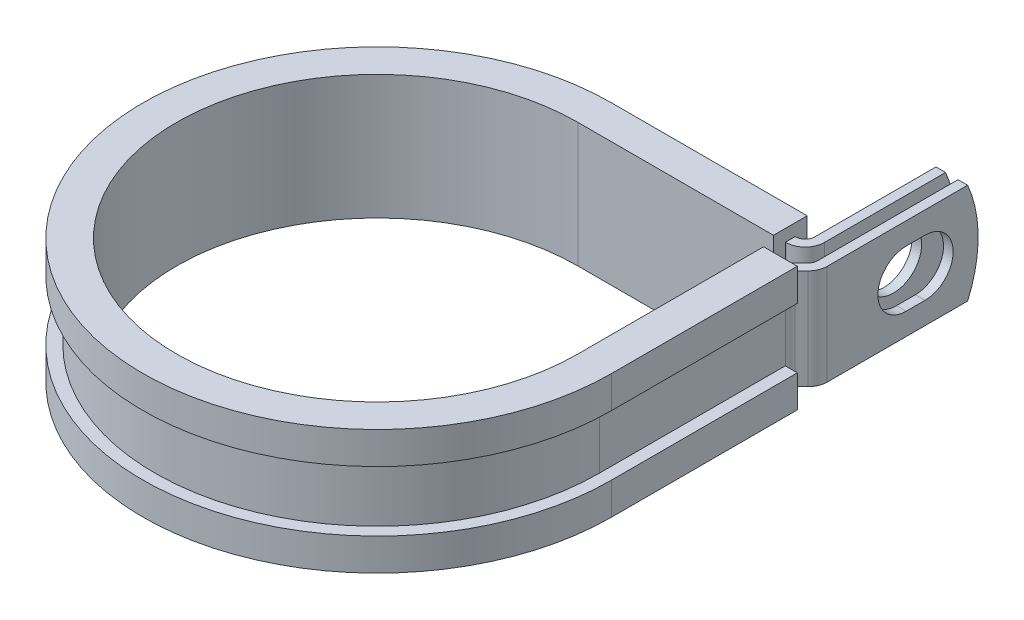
ISO-10303-21;
HEADER;
FILE_DESCRIPTION(('STEP AP214'),'2;1');
FILE_NAME('part.step','',(''),(''),'','','');
FILE_SCHEMA(('AUTOMOTIVE_DESIGN { 1 0 10303 214 1 1 1 1 }'));
ENDSEC;
DATA;
#1=APPLICATION_CONTEXT('core data for automotive mechanical design processes');
#2=APPLICATION_PROTOCOL_DEFINITION('international standard','automotive_design',2000,#1);
#3=PRODUCT_CONTEXT('',#1,'mechanical');
#4=PRODUCT('Part','Part','',(#3));
#5=PRODUCT_RELATED_PRODUCT_CATEGORY('part','',(#4));
#6=PRODUCT_DEFINITION_FORMATION('','',#4);
#7=PRODUCT_DEFINITION_CONTEXT('part definition',#1,'design');
#8=PRODUCT_DEFINITION('design','',#6,#7);
#9=PRODUCT_DEFINITION_SHAPE('','',#8);
#10=(LENGTH_UNIT() NAMED_UNIT(*) SI_UNIT(.MILLI.,.METRE.));
#11=(NAMED_UNIT(*) PLANE_ANGLE_UNIT() SI_UNIT($,.RADIAN.));
#12=(NAMED_UNIT(*) SI_UNIT($,.STERADIAN.) SOLID_ANGLE_UNIT());
#13=UNCERTAINTY_MEASURE_WITH_UNIT(LENGTH_MEASURE(1.E-05),#10,'distance_accuracy_value','');
#14=(GEOMETRIC_REPRESENTATION_CONTEXT(3) GLOBAL_UNCERTAINTY_ASSIGNED_CONTEXT((#13)) GLOBAL_UNIT_ASSIGNED_CONTEXT((#10,
#11,#12)) REPRESENTATION_CONTEXT('',''));
#15=CARTESIAN_POINT('',(0.,0.,0.));
#16=DIRECTION('',(0.,0.,1.));
#17=DIRECTION('',(1.,0.,0.));
#18=AXIS2_PLACEMENT_3D('',#15,#16,#17);
#19=CARTESIAN_POINT('',(27.6022698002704,-6.35,-26.924));
#20=DIRECTION('',(0.,1.,0.));
#21=DIRECTION('',(1.,0.,0.));
#22=AXIS2_PLACEMENT_3D('',#19,#20,#21);
#23=PLANE('',#22);
#24=DIRECTION('',(0.,0.,-1.));
#25=VECTOR('',#24,1.);
#26=CARTESIAN_POINT('',(24.7574698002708,-6.35,-26.924));
#27=LINE('',#26,#25);
#28=CARTESIAN_POINT('',(24.7574698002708,-6.35,-26.924));
#29=VERTEX_POINT('',#28);
#30=CARTESIAN_POINT('',(24.7574698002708,-6.35,-28.1432));
#31=VERTEX_POINT('',#30);
#32=EDGE_CURVE('E523',#29,#31,#27,.T.);
#33=ORIENTED_EDGE('',*,*,#32,.T.);
#34=DIRECTION('',(-1.,0.,0.));
#35=VECTOR('',#34,1.);
#36=CARTESIAN_POINT('',(0.,-6.35,-28.1432));
#37=LINE('',#36,#35);
#38=CARTESIAN_POINT('',(24.8082698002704,-6.35,-28.1432));
#39=VERTEX_POINT('',#38);
#40=EDGE_CURVE('E410',#39,#31,#37,.T.);
#41=ORIENTED_EDGE('',*,*,#40,.F.);
#42=CARTESIAN_POINT('',(24.8082698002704,-6.35,-29.3624));
#43=DIRECTION('',(0.,1.,0.));
#44=DIRECTION('',(1.,0.,0.));
#45=AXIS2_PLACEMENT_3D('',#42,#43,#44);
#46=CIRCLE('',#45,1.2192);
#47=CARTESIAN_POINT('',(26.0274698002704,-6.35,-29.3624));
#48=VERTEX_POINT('',#47);
#49=EDGE_CURVE('E408',#48,#39,#46,.F.);
#50=ORIENTED_EDGE('',*,*,#49,.F.);
#51=DIRECTION('',(0.,0.,-1.));
#52=VECTOR('',#51,1.);
#53=CARTESIAN_POINT('',(26.0274698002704,-6.35,-46.0248));
#54=LINE('',#53,#52);
#55=CARTESIAN_POINT('',(26.0274698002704,-6.35,-44.6994778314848));
#56=VERTEX_POINT('',#55);
#57=EDGE_CURVE('E406',#56,#48,#54,.F.);
#58=ORIENTED_EDGE('',*,*,#57,.F.);
#59=DIRECTION('',(-1.,0.,0.));
#60=VECTOR('',#59,1.);
#61=CARTESIAN_POINT('',(30.0406698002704,-6.35,-44.6994778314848));
#62=LINE('',#61,#60);
#63=CARTESIAN_POINT('',(27.2466698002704,-6.35,-44.6994778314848));
#64=VERTEX_POINT('',#63);
#65=EDGE_CURVE('E12',#64,#56,#62,.T.);
#66=ORIENTED_EDGE('',*,*,#65,.F.);
#67=DIRECTION('',(0.,0.,1.));
#68=VECTOR('',#67,1.);
#69=CARTESIAN_POINT('',(27.2466698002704,-6.35,-46.0248));
#70=LINE('',#69,#68);
#71=CARTESIAN_POINT('',(27.2466698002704,-6.35,-29.3624));
#72=VERTEX_POINT('',#71);
#73=EDGE_CURVE('E404',#64,#72,#70,.T.);
#74=ORIENTED_EDGE('',*,*,#73,.T.);
#75=CARTESIAN_POINT('',(24.8082698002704,-6.35,-29.3624));
#76=DIRECTION('',(0.,-1.,0.));
#77=DIRECTION('',(0.,0.,1.));
#78=AXIS2_PLACEMENT_3D('',#75,#76,#77);
#79=CIRCLE('',#78,2.4384);
#80=CARTESIAN_POINT('',(24.8082698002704,-6.35,-26.924));
#81=VERTEX_POINT('',#80);
#82=EDGE_CURVE('E401',#72,#81,#79,.T.);
#83=ORIENTED_EDGE('',*,*,#82,.T.);
#84=DIRECTION('',(-1.,0.,0.));
#85=VECTOR('',#84,1.);
#86=CARTESIAN_POINT('',(0.,-6.35,-26.924));
#87=LINE('',#86,#85);
#88=EDGE_CURVE('E398',#81,#29,#87,.T.);
#89=ORIENTED_EDGE('',*,*,#88,.T.);
#90=EDGE_LOOP('',(#33,#41,#50,#58,#66,#74,#83,#89));
#91=FACE_BOUND('',#90,.T.);
#92=ADVANCED_FACE('F54',(#91),#23,.F.);
#93=CARTESIAN_POINT('',(27.6022698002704,6.35,-26.924));
#94=DIRECTION('',(0.,1.,0.));
#95=DIRECTION('',(1.,0.,0.));
#96=AXIS2_PLACEMENT_3D('',#93,#94,#95);
#97=PLANE('',#96);
#98=DIRECTION('',(-1.,0.,0.));
#99=VECTOR('',#98,1.);
#100=CARTESIAN_POINT('',(0.,6.35,-28.1432));
#101=LINE('',#100,#99);
#102=CARTESIAN_POINT('',(24.8082698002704,6.35,-28.1432));
#103=VERTEX_POINT('',#102);
#104=CARTESIAN_POINT('',(24.7574698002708,6.35,-28.1432));
#105=VERTEX_POINT('',#104);
#106=EDGE_CURVE('E368',#103,#105,#101,.T.);
#107=ORIENTED_EDGE('',*,*,#106,.T.);
#108=DIRECTION('',(0.,0.,1.));
#109=VECTOR('',#108,1.);
#110=CARTESIAN_POINT('',(24.7574698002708,6.35,-28.1432));
#111=LINE('',#110,#109);
#112=CARTESIAN_POINT('',(24.7574698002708,6.35,-26.924));
#113=VERTEX_POINT('',#112);
#114=EDGE_CURVE('E517',#105,#113,#111,.T.);
#115=ORIENTED_EDGE('',*,*,#114,.T.);
#116=DIRECTION('',(-1.,0.,0.));
#117=VECTOR('',#116,1.);
#118=CARTESIAN_POINT('',(0.,6.35,-26.924));
#119=LINE('',#118,#117);
#120=CARTESIAN_POINT('',(24.8082698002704,6.35,-26.924));
#121=VERTEX_POINT('',#120);
#122=EDGE_CURVE('E625',#121,#113,#119,.T.);
#123=ORIENTED_EDGE('',*,*,#122,.F.);
#124=CARTESIAN_POINT('',(24.8082698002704,6.35,-29.3624));
#125=DIRECTION('',(0.,-1.,0.));
#126=DIRECTION('',(0.,0.,1.));
#127=AXIS2_PLACEMENT_3D('',#124,#125,#126);
#128=CIRCLE('',#127,2.4384);
#129=CARTESIAN_POINT('',(27.2466698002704,6.35,-29.3624));
#130=VERTEX_POINT('',#129);
#131=EDGE_CURVE('E370',#130,#121,#128,.T.);
#132=ORIENTED_EDGE('',*,*,#131,.F.);
#133=DIRECTION('',(0.,0.,1.));
#134=VECTOR('',#133,1.);
#135=CARTESIAN_POINT('',(27.2466698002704,6.35,-46.0248));
#136=LINE('',#135,#134);
#137=CARTESIAN_POINT('',(27.2466698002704,6.35,-44.6994778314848));
#138=VERTEX_POINT('',#137);
#139=EDGE_CURVE('E361',#138,#130,#136,.T.);
#140=ORIENTED_EDGE('',*,*,#139,.F.);
#141=DIRECTION('',(-1.,0.,0.));
#142=VECTOR('',#141,1.);
#143=CARTESIAN_POINT('',(30.0406698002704,6.35,-44.6994778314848));
#144=LINE('',#143,#142);
#145=CARTESIAN_POINT('',(26.0274698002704,6.35,-44.6994778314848));
#146=VERTEX_POINT('',#145);
#147=EDGE_CURVE('E62',#138,#146,#144,.T.);
#148=ORIENTED_EDGE('',*,*,#147,.T.);
#149=DIRECTION('',(0.,0.,-1.));
#150=VECTOR('',#149,1.);
#151=CARTESIAN_POINT('',(26.0274698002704,6.35,-46.0248));
#152=LINE('',#151,#150);
#153=CARTESIAN_POINT('',(26.0274698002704,6.35,-29.3624));
#154=VERTEX_POINT('',#153);
#155=EDGE_CURVE('E358',#146,#154,#152,.F.);
#156=ORIENTED_EDGE('',*,*,#155,.T.);
#157=CARTESIAN_POINT('',(24.8082698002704,6.35,-29.3624));
#158=DIRECTION('',(0.,1.,0.));
#159=DIRECTION('',(1.,0.,0.));
#160=AXIS2_PLACEMENT_3D('',#157,#158,#159);
#161=CIRCLE('',#160,1.2192);
#162=EDGE_CURVE('E366',#154,#103,#161,.F.);
#163=ORIENTED_EDGE('',*,*,#162,.T.);
#164=EDGE_LOOP('',(#107,#115,#123,#132,#140,#148,#156,#163));
#165=FACE_BOUND('',#164,.T.);
#166=ADVANCED_FACE('F357',(#165),#97,.T.);
#167=CARTESIAN_POINT('',(0.,6.35,-26.924));
#168=DIRECTION('',(0.,0.,1.));
#169=DIRECTION('',(1.,0.,0.));
#170=AXIS2_PLACEMENT_3D('',#167,#168,#169);
#171=PLANE('',#170);
#172=ORIENTED_EDGE('',*,*,#122,.T.);
#173=DIRECTION('',(0.,-1.,0.));
#174=VECTOR('',#173,1.);
#175=CARTESIAN_POINT('',(24.7574698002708,6.35,-26.924));
#176=LINE('',#175,#174);
#177=EDGE_CURVE('E520',#113,#29,#176,.T.);
#178=ORIENTED_EDGE('',*,*,#177,.T.);
#179=ORIENTED_EDGE('',*,*,#88,.F.);
#180=DIRECTION('',(0.,-1.,0.));
#181=VECTOR('',#180,1.);
#182=CARTESIAN_POINT('',(24.8082698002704,6.35,-26.924));
#183=LINE('',#182,#181);
#184=EDGE_CURVE('E344',#121,#81,#183,.T.);
#185=ORIENTED_EDGE('',*,*,#184,.F.);
#186=EDGE_LOOP('',(#172,#178,#179,#185));
#187=FACE_BOUND('',#186,.T.);
#188=ADVANCED_FACE('F635',(#187),#171,.T.);
#189=CARTESIAN_POINT('',(30.0406698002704,6.35,-26.924));
#190=DIRECTION('',(-1.,0.,0.));
#191=DIRECTION('',(0.,0.,1.));
#192=AXIS2_PLACEMENT_3D('',#189,#190,#191);
#193=PLANE('',#192);
#194=CARTESIAN_POINT('',(30.0406698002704,0.,-39.2937999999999));
#195=DIRECTION('',(1.,0.,0.));
#196=DIRECTION('',(0.,0.,-1.));
#197=AXIS2_PLACEMENT_3D('',#194,#195,#196);
#198=CIRCLE('',#197,3.5687);
#199=CARTESIAN_POINT('',(30.0406698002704,-3.5687,-39.2938000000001));
#200=VERTEX_POINT('',#199);
#201=CARTESIAN_POINT('',(30.0406698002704,3.5687,-39.2938000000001));
#202=VERTEX_POINT('',#201);
#203=EDGE_CURVE('E580',#200,#202,#198,.T.);
#204=ORIENTED_EDGE('',*,*,#203,.F.);
#205=DIRECTION('',(0.,0.,-1.));
#206=VECTOR('',#205,1.);
#207=CARTESIAN_POINT('',(30.0406698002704,-3.5687,-36.9061999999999));
#208=LINE('',#207,#206);
#209=CARTESIAN_POINT('',(30.0406698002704,-3.5687,-36.9061999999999));
#210=VERTEX_POINT('',#209);
#211=EDGE_CURVE('E583',#210,#200,#208,.T.);
#212=ORIENTED_EDGE('',*,*,#211,.F.);
#213=CARTESIAN_POINT('',(30.0406698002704,0.,-36.9061999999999));
#214=DIRECTION('',(1.,0.,0.));
#215=DIRECTION('',(0.,0.,-1.));
#216=AXIS2_PLACEMENT_3D('',#213,#214,#215);
#217=CIRCLE('',#216,3.5687);
#218=CARTESIAN_POINT('',(30.0406698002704,3.5687,-36.9061999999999));
#219=VERTEX_POINT('',#218);
#220=EDGE_CURVE('E576',#219,#210,#217,.T.);
#221=ORIENTED_EDGE('',*,*,#220,.F.);
#222=DIRECTION('',(0.,0.,1.));
#223=VECTOR('',#222,1.);
#224=CARTESIAN_POINT('',(30.0406698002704,3.5687,-36.9061999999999));
#225=LINE('',#224,#223);
#226=EDGE_CURVE('E577',#202,#219,#225,.T.);
#227=ORIENTED_EDGE('',*,*,#226,.F.);
#228=EDGE_LOOP('',(#204,#212,#221,#227));
#229=FACE_BOUND('',#228,.T.);
#230=DIRECTION('',(0.,0.,-1.));
#231=VECTOR('',#230,1.);
#232=CARTESIAN_POINT('',(30.0406698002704,-6.35,-26.924));
#233=LINE('',#232,#231);
#234=CARTESIAN_POINT('',(30.0406698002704,-6.35,-26.924));
#235=VERTEX_POINT('',#234);
#236=CARTESIAN_POINT('',(30.0406698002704,-6.35,-44.6994778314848));
#237=VERTEX_POINT('',#236);
#238=EDGE_CURVE('E382',#235,#237,#233,.T.);
#239=ORIENTED_EDGE('',*,*,#238,.T.);
#240=CARTESIAN_POINT('',(30.0406698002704,0.,-30.1498));
#241=DIRECTION('',(-1.,0.,0.));
#242=DIRECTION('',(0.,0.,1.));
#243=AXIS2_PLACEMENT_3D('',#240,#241,#242);
#244=CIRCLE('',#243,15.875);
#245=CARTESIAN_POINT('',(30.0406698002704,6.35,-44.6994778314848));
#246=VERTEX_POINT('',#245);
#247=EDGE_CURVE('E568',#246,#237,#244,.T.);
#248=ORIENTED_EDGE('',*,*,#247,.F.);
#249=DIRECTION('',(0.,0.,-1.));
#250=VECTOR('',#249,1.);
#251=CARTESIAN_POINT('',(30.0406698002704,6.35,-26.924));
#252=LINE('',#251,#250);
#253=CARTESIAN_POINT('',(30.0406698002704,6.35,-26.924));
#254=VERTEX_POINT('',#253);
#255=EDGE_CURVE('E419',#254,#246,#252,.T.);
#256=ORIENTED_EDGE('',*,*,#255,.F.);
#257=DIRECTION('',(0.,-1.,0.));
#258=VECTOR('',#257,1.);
#259=CARTESIAN_POINT('',(30.0406698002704,6.35,-26.924));
#260=LINE('',#259,#258);
#261=EDGE_CURVE('E381',#254,#235,#260,.T.);
#262=ORIENTED_EDGE('',*,*,#261,.T.);
#263=EDGE_LOOP('',(#239,#248,#256,#262));
#264=FACE_BOUND('',#263,.T.);
#265=ADVANCED_FACE('F56',(#229,#264),#193,.F.);
#266=CARTESIAN_POINT('',(28.8214698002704,6.35,-26.924));
#267=DIRECTION('',(-1.,0.,0.));
#268=DIRECTION('',(0.,0.,1.));
#269=AXIS2_PLACEMENT_3D('',#266,#267,#268);
#270=PLANE('',#269);
#271=DIRECTION('',(0.,0.,-1.));
#272=VECTOR('',#271,1.);
#273=CARTESIAN_POINT('',(28.8214698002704,-3.5687,-36.9061999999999));
#274=LINE('',#273,#272);
#275=CARTESIAN_POINT('',(28.8214698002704,-3.5687,-36.9061999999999));
#276=VERTEX_POINT('',#275);
#277=CARTESIAN_POINT('',(28.8214698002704,-3.5687,-39.2938000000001));
#278=VERTEX_POINT('',#277);
#279=EDGE_CURVE('E579',#276,#278,#274,.T.);
#280=ORIENTED_EDGE('',*,*,#279,.T.);
#281=CARTESIAN_POINT('',(28.8214698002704,0.,-39.2937999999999));
#282=DIRECTION('',(-1.,0.,0.));
#283=DIRECTION('',(0.,0.,1.));
#284=AXIS2_PLACEMENT_3D('',#281,#282,#283);
#285=CIRCLE('',#284,3.5687);
#286=CARTESIAN_POINT('',(28.8214698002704,3.5687,-39.2938000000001));
#287=VERTEX_POINT('',#286);
#288=EDGE_CURVE('E600',#278,#287,#285,.F.);
#289=ORIENTED_EDGE('',*,*,#288,.T.);
#290=DIRECTION('',(0.,0.,1.));
#291=VECTOR('',#290,1.);
#292=CARTESIAN_POINT('',(28.8214698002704,3.5687,-36.9061999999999));
#293=LINE('',#292,#291);
#294=CARTESIAN_POINT('',(28.8214698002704,3.5687,-36.9061999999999));
#295=VERTEX_POINT('',#294);
#296=EDGE_CURVE('E596',#287,#295,#293,.T.);
#297=ORIENTED_EDGE('',*,*,#296,.T.);
#298=CARTESIAN_POINT('',(28.8214698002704,0.,-36.9061999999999));
#299=DIRECTION('',(-1.,0.,0.));
#300=DIRECTION('',(0.,0.,1.));
#301=AXIS2_PLACEMENT_3D('',#298,#299,#300);
#302=CIRCLE('',#301,3.5687);
#303=EDGE_CURVE('E591',#295,#276,#302,.F.);
#304=ORIENTED_EDGE('',*,*,#303,.T.);
#305=EDGE_LOOP('',(#280,#289,#297,#304));
#306=FACE_BOUND('',#305,.T.);
#307=CARTESIAN_POINT('',(28.8214698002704,0.,-30.1498));
#308=DIRECTION('',(-1.,0.,0.));
#309=DIRECTION('',(0.,0.,1.));
#310=AXIS2_PLACEMENT_3D('',#307,#308,#309);
#311=CIRCLE('',#310,15.875);
#312=CARTESIAN_POINT('',(28.8214698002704,6.35,-44.6994778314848));
#313=VERTEX_POINT('',#312);
#314=CARTESIAN_POINT('',(28.8214698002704,-6.35,-44.6994778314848));
#315=VERTEX_POINT('',#314);
#316=EDGE_CURVE('E76',#313,#315,#311,.T.);
#317=ORIENTED_EDGE('',*,*,#316,.T.);
#318=DIRECTION('',(0.,0.,-1.));
#319=VECTOR('',#318,1.);
#320=CARTESIAN_POINT('',(28.8214698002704,-6.35,-26.924));
#321=LINE('',#320,#319);
#322=CARTESIAN_POINT('',(28.8214698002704,-6.35,-26.924));
#323=VERTEX_POINT('',#322);
#324=EDGE_CURVE('E385',#323,#315,#321,.T.);
#325=ORIENTED_EDGE('',*,*,#324,.F.);
#326=DIRECTION('',(0.,-1.,0.));
#327=VECTOR('',#326,1.);
#328=CARTESIAN_POINT('',(28.8214698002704,6.35,-26.924));
#329=LINE('',#328,#327);
#330=CARTESIAN_POINT('',(28.8214698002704,6.35,-26.924));
#331=VERTEX_POINT('',#330);
#332=EDGE_CURVE('E352',#331,#323,#329,.T.);
#333=ORIENTED_EDGE('',*,*,#332,.F.);
#334=DIRECTION('',(0.,0.,-1.));
#335=VECTOR('',#334,1.);
#336=CARTESIAN_POINT('',(28.8214698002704,6.35,-26.924));
#337=LINE('',#336,#335);
#338=EDGE_CURVE('E615',#331,#313,#337,.T.);
#339=ORIENTED_EDGE('',*,*,#338,.T.);
#340=EDGE_LOOP('',(#317,#325,#333,#339));
#341=FACE_BOUND('',#340,.T.);
#342=ADVANCED_FACE('F689',(#306,#341),#270,.T.);
#343=CARTESIAN_POINT('',(27.2466698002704,6.35,-46.0248));
#344=DIRECTION('',(1.,0.,0.));
#345=DIRECTION('',(0.,0.,-1.));
#346=AXIS2_PLACEMENT_3D('',#343,#344,#345);
#347=PLANE('',#346);
#348=CARTESIAN_POINT('',(27.2466698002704,0.,-38.1));
#349=DIRECTION('',(1.,0.,0.));
#350=DIRECTION('',(0.,0.,-1.));
#351=AXIS2_PLACEMENT_3D('',#348,#349,#350);
#352=CIRCLE('',#351,3.5687);
#353=CARTESIAN_POINT('',(27.2466698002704,0.,-41.6687));
#354=VERTEX_POINT('',#353);
#355=EDGE_CURVE('E386',#354,#354,#352,.F.);
#356=ORIENTED_EDGE('',*,*,#355,.T.);
#357=EDGE_LOOP('',(#356));
#358=FACE_BOUND('',#357,.T.);
#359=ORIENTED_EDGE('',*,*,#73,.F.);
#360=CARTESIAN_POINT('',(27.2466698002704,0.,-30.1498));
#361=DIRECTION('',(1.,0.,0.));
#362=DIRECTION('',(0.,0.,-1.));
#363=AXIS2_PLACEMENT_3D('',#360,#361,#362);
#364=CIRCLE('',#363,15.875);
#365=EDGE_CURVE('E573',#64,#138,#364,.T.);
#366=ORIENTED_EDGE('',*,*,#365,.T.);
#367=ORIENTED_EDGE('',*,*,#139,.T.);
#368=DIRECTION('',(0.,-1.,0.));
#369=VECTOR('',#368,1.);
#370=CARTESIAN_POINT('',(27.2466698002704,6.35,-29.3624));
#371=LINE('',#370,#369);
#372=EDGE_CURVE('E341',#130,#72,#371,.T.);
#373=ORIENTED_EDGE('',*,*,#372,.T.);
#374=EDGE_LOOP('',(#359,#366,#367,#373));
#375=FACE_BOUND('',#374,.T.);
#376=ADVANCED_FACE('F641',(#358,#375),#347,.T.);
#377=CARTESIAN_POINT('',(26.0274698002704,6.35,-46.0248));
#378=DIRECTION('',(1.,0.,0.));
#379=DIRECTION('',(0.,0.,-1.));
#380=AXIS2_PLACEMENT_3D('',#377,#378,#379);
#381=PLANE('',#380);
#382=CARTESIAN_POINT('',(26.0274698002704,0.,-38.1));
#383=DIRECTION('',(-1.,0.,0.));
#384=DIRECTION('',(0.,0.,1.));
#385=AXIS2_PLACEMENT_3D('',#382,#383,#384);
#386=CIRCLE('',#385,3.5687);
#387=CARTESIAN_POINT('',(26.0274698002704,0.,-34.5313));
#388=VERTEX_POINT('',#387);
#389=EDGE_CURVE('E608',#388,#388,#386,.T.);
#390=ORIENTED_EDGE('',*,*,#389,.F.);
#391=EDGE_LOOP('',(#390));
#392=FACE_BOUND('',#391,.T.);
#393=CARTESIAN_POINT('',(26.0274698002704,0.,-30.1498));
#394=DIRECTION('',(-1.,0.,0.));
#395=DIRECTION('',(0.,0.,1.));
#396=AXIS2_PLACEMENT_3D('',#393,#394,#395);
#397=CIRCLE('',#396,15.875);
#398=EDGE_CURVE('E68',#146,#56,#397,.T.);
#399=ORIENTED_EDGE('',*,*,#398,.T.);
#400=ORIENTED_EDGE('',*,*,#57,.T.);
#401=DIRECTION('',(0.,-1.,0.));
#402=VECTOR('',#401,1.);
#403=CARTESIAN_POINT('',(26.0274698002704,6.35,-29.3624));
#404=LINE('',#403,#402);
#405=EDGE_CURVE('E338',#154,#48,#404,.T.);
#406=ORIENTED_EDGE('',*,*,#405,.F.);
#407=ORIENTED_EDGE('',*,*,#155,.F.);
#408=EDGE_LOOP('',(#399,#400,#406,#407));
#409=FACE_BOUND('',#408,.T.);
#410=ADVANCED_FACE('F364',(#392,#409),#381,.F.);
#411=CARTESIAN_POINT('',(29.3624,-6.35,-23.5115026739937));
#412=DIRECTION('',(0.,1.,0.));
#413=DIRECTION('',(1.,0.,0.));
#414=AXIS2_PLACEMENT_3D('',#411,#412,#413);
#415=CIRCLE('',#414,1.2192);
#416=CARTESIAN_POINT('',(28.1432,-6.35,-23.5115026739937));
#417=VERTEX_POINT('',#416);
#418=CARTESIAN_POINT('',(28.5002954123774,-6.35,-24.3736072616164));
#419=VERTEX_POINT('',#418);
#420=EDGE_CURVE('E413',#417,#419,#415,.F.);
#421=ORIENTED_EDGE('',*,*,#420,.F.);
#422=DIRECTION('',(1.,0.,0.));
#423=VECTOR('',#422,1.);
#424=CARTESIAN_POINT('',(26.924,-6.35,-23.5115026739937));
#425=LINE('',#424,#423);
#426=CARTESIAN_POINT('',(26.924,-6.35,-23.5115026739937));
#427=VERTEX_POINT('',#426);
#428=EDGE_CURVE('E451',#427,#417,#425,.T.);
#429=ORIENTED_EDGE('',*,*,#428,.F.);
#430=CARTESIAN_POINT('',(29.3624,-6.35,-23.5115026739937));
#431=DIRECTION('',(0.,-1.,0.));
#432=DIRECTION('',(0.,0.,1.));
#433=AXIS2_PLACEMENT_3D('',#430,#431,#432);
#434=CIRCLE('',#433,2.4384);
#435=CARTESIAN_POINT('',(27.6381908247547,-6.35,-25.235711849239));
#436=VERTEX_POINT('',#435);
#437=EDGE_CURVE('E395',#427,#436,#434,.T.);
#438=ORIENTED_EDGE('',*,*,#437,.T.);
#439=DIRECTION('',(0.707106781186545,0.,-0.70710678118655));
#440=VECTOR('',#439,1.);
#441=CARTESIAN_POINT('',(27.6381908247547,-6.35,-25.235711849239));
#442=LINE('',#441,#440);
#443=CARTESIAN_POINT('',(28.4643743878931,-6.35,-26.0618954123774));
#444=VERTEX_POINT('',#443);
#445=EDGE_CURVE('E392',#436,#444,#442,.T.);
#446=ORIENTED_EDGE('',*,*,#445,.T.);
#447=CARTESIAN_POINT('',(27.6022698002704,-6.35,-26.924));
#448=DIRECTION('',(0.,1.,0.));
#449=DIRECTION('',(0.,0.,1.));
#450=AXIS2_PLACEMENT_3D('',#447,#448,#449);
#451=CIRCLE('',#450,1.2192);
#452=EDGE_CURVE('E389',#444,#323,#451,.T.);
#453=ORIENTED_EDGE('',*,*,#452,.T.);
#454=ORIENTED_EDGE('',*,*,#324,.T.);
#455=DIRECTION('',(-1.,0.,0.));
#456=VECTOR('',#455,1.);
#457=CARTESIAN_POINT('',(30.0406698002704,-6.35,-44.6994778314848));
#458=LINE('',#457,#456);
#459=EDGE_CURVE('E566',#237,#315,#458,.T.);
#460=ORIENTED_EDGE('',*,*,#459,.F.);
#461=ORIENTED_EDGE('',*,*,#238,.F.);
#462=CARTESIAN_POINT('',(27.6022698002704,-6.35,-26.924));
#463=DIRECTION('',(0.,1.,0.));
#464=DIRECTION('',(1.,0.,0.));
#465=AXIS2_PLACEMENT_3D('',#462,#463,#464);
#466=CIRCLE('',#465,2.4384);
#467=CARTESIAN_POINT('',(29.3264789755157,-6.35,-25.1997908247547));
#468=VERTEX_POINT('',#467);
#469=EDGE_CURVE('E417',#468,#235,#466,.T.);
#470=ORIENTED_EDGE('',*,*,#469,.F.);
#471=DIRECTION('',(0.707106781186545,0.,-0.70710678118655));
#472=VECTOR('',#471,1.);
#473=CARTESIAN_POINT('',(28.5002954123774,-6.35,-24.3736072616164));
#474=LINE('',#473,#472);
#475=EDGE_CURVE('E415',#419,#468,#474,.T.);
#476=ORIENTED_EDGE('',*,*,#475,.F.);
#477=EDGE_LOOP('',(#421,#429,#438,#446,#453,#454,#460,#461,#470,#476));
#478=FACE_BOUND('',#477,.T.);
#479=ADVANCED_FACE('F675',(#478),#23,.F.);
#480=DIRECTION('',(-1.,0.,0.));
#481=VECTOR('',#480,1.);
#482=CARTESIAN_POINT('',(28.1432,6.35,-23.5115026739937));
#483=LINE('',#482,#481);
#484=CARTESIAN_POINT('',(28.1432,6.35,-23.5115026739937));
#485=VERTEX_POINT('',#484);
#486=CARTESIAN_POINT('',(26.924,6.35,-23.5115026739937));
#487=VERTEX_POINT('',#486);
#488=EDGE_CURVE('E440',#485,#487,#483,.T.);
#489=ORIENTED_EDGE('',*,*,#488,.F.);
#490=CARTESIAN_POINT('',(29.3624,6.35,-23.5115026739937));
#491=DIRECTION('',(0.,1.,0.));
#492=DIRECTION('',(1.,0.,0.));
#493=AXIS2_PLACEMENT_3D('',#490,#491,#492);
#494=CIRCLE('',#493,1.2192);
#495=CARTESIAN_POINT('',(28.5002954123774,6.35,-24.3736072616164));
#496=VERTEX_POINT('',#495);
#497=EDGE_CURVE('E375',#485,#496,#494,.F.);
#498=ORIENTED_EDGE('',*,*,#497,.T.);
#499=DIRECTION('',(0.707106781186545,0.,-0.70710678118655));
#500=VECTOR('',#499,1.);
#501=CARTESIAN_POINT('',(28.5002954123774,6.35,-24.3736072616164));
#502=LINE('',#501,#500);
#503=CARTESIAN_POINT('',(29.3264789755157,6.35,-25.1997908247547));
#504=VERTEX_POINT('',#503);
#505=EDGE_CURVE('E377',#496,#504,#502,.T.);
#506=ORIENTED_EDGE('',*,*,#505,.T.);
#507=CARTESIAN_POINT('',(27.6022698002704,6.35,-26.924));
#508=DIRECTION('',(0.,1.,0.));
#509=DIRECTION('',(1.,0.,0.));
#510=AXIS2_PLACEMENT_3D('',#507,#508,#509);
#511=CIRCLE('',#510,2.4384);
#512=EDGE_CURVE('E379',#504,#254,#511,.T.);
#513=ORIENTED_EDGE('',*,*,#512,.T.);
#514=ORIENTED_EDGE('',*,*,#255,.T.);
#515=DIRECTION('',(-1.,0.,0.));
#516=VECTOR('',#515,1.);
#517=CARTESIAN_POINT('',(30.0406698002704,6.35,-44.6994778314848));
#518=LINE('',#517,#516);
#519=EDGE_CURVE('E570',#246,#313,#518,.T.);
#520=ORIENTED_EDGE('',*,*,#519,.T.);
#521=ORIENTED_EDGE('',*,*,#338,.F.);
#522=CARTESIAN_POINT('',(27.6022698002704,6.35,-26.924));
#523=DIRECTION('',(0.,1.,0.));
#524=DIRECTION('',(0.,0.,1.));
#525=AXIS2_PLACEMENT_3D('',#522,#523,#524);
#526=CIRCLE('',#525,1.2192);
#527=CARTESIAN_POINT('',(28.4643743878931,6.35,-26.0618954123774));
#528=VERTEX_POINT('',#527);
#529=EDGE_CURVE('E618',#528,#331,#526,.T.);
#530=ORIENTED_EDGE('',*,*,#529,.F.);
#531=DIRECTION('',(0.707106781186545,0.,-0.70710678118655));
#532=VECTOR('',#531,1.);
#533=CARTESIAN_POINT('',(27.6381908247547,6.35,-25.235711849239));
#534=LINE('',#533,#532);
#535=CARTESIAN_POINT('',(27.6381908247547,6.35,-25.235711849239));
#536=VERTEX_POINT('',#535);
#537=EDGE_CURVE('E621',#536,#528,#534,.T.);
#538=ORIENTED_EDGE('',*,*,#537,.F.);
#539=CARTESIAN_POINT('',(29.3624,6.35,-23.5115026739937));
#540=DIRECTION('',(0.,-1.,0.));
#541=DIRECTION('',(0.,0.,1.));
#542=AXIS2_PLACEMENT_3D('',#539,#540,#541);
#543=CIRCLE('',#542,2.4384);
#544=EDGE_CURVE('E450',#487,#536,#543,.T.);
#545=ORIENTED_EDGE('',*,*,#544,.F.);
#546=EDGE_LOOP('',(#489,#498,#506,#513,#514,#520,#521,#530,#538,#545));
#547=FACE_BOUND('',#546,.T.);
#548=ADVANCED_FACE('F447',(#547),#97,.T.);
#549=CARTESIAN_POINT('',(27.6022698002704,6.35,-26.924));
#550=DIRECTION('',(0.,-1.,0.));
#551=DIRECTION('',(0.,0.,-1.));
#552=AXIS2_PLACEMENT_3D('',#549,#550,#551);
#553=CYLINDRICAL_SURFACE('',#552,1.2192);
#554=ORIENTED_EDGE('',*,*,#452,.F.);
#555=DIRECTION('',(0.,-1.,0.));
#556=VECTOR('',#555,1.);
#557=CARTESIAN_POINT('',(28.4643743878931,6.35,-26.0618954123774));
#558=LINE('',#557,#556);
#559=EDGE_CURVE('E350',#528,#444,#558,.T.);
#560=ORIENTED_EDGE('',*,*,#559,.F.);
#561=ORIENTED_EDGE('',*,*,#529,.T.);
#562=ORIENTED_EDGE('',*,*,#332,.T.);
#563=EDGE_LOOP('',(#554,#560,#561,#562));
#564=FACE_BOUND('',#563,.T.);
#565=ADVANCED_FACE('F685',(#564),#553,.F.);
#566=CARTESIAN_POINT('',(27.6381908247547,6.35,-25.235711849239));
#567=DIRECTION('',(-0.70710678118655,0.,-0.707106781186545));
#568=DIRECTION('',(-0.707106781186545,0.,0.70710678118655));
#569=AXIS2_PLACEMENT_3D('',#566,#567,#568);
#570=PLANE('',#569);
#571=ORIENTED_EDGE('',*,*,#445,.F.);
#572=DIRECTION('',(0.,-1.,0.));
#573=VECTOR('',#572,1.);
#574=CARTESIAN_POINT('',(27.6381908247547,6.35,-25.235711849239));
#575=LINE('',#574,#573);
#576=EDGE_CURVE('E348',#536,#436,#575,.T.);
#577=ORIENTED_EDGE('',*,*,#576,.F.);
#578=ORIENTED_EDGE('',*,*,#537,.T.);
#579=ORIENTED_EDGE('',*,*,#559,.T.);
#580=EDGE_LOOP('',(#571,#577,#578,#579));
#581=FACE_BOUND('',#580,.T.);
#582=ADVANCED_FACE('F680',(#581),#570,.T.);
#583=CARTESIAN_POINT('',(29.3624,6.35,-23.5115026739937));
#584=DIRECTION('',(0.,-1.,0.));
#585=DIRECTION('',(0.,0.,-1.));
#586=AXIS2_PLACEMENT_3D('',#583,#584,#585);
#587=CYLINDRICAL_SURFACE('',#586,2.4384);
#588=ORIENTED_EDGE('',*,*,#437,.F.);
#589=DIRECTION('',(0.,-1.,0.));
#590=VECTOR('',#589,1.);
#591=CARTESIAN_POINT('',(26.924,6.35,-23.5115026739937));
#592=LINE('',#591,#590);
#593=EDGE_CURVE('E346',#487,#427,#592,.T.);
#594=ORIENTED_EDGE('',*,*,#593,.F.);
#595=ORIENTED_EDGE('',*,*,#544,.T.);
#596=ORIENTED_EDGE('',*,*,#576,.T.);
#597=EDGE_LOOP('',(#588,#594,#595,#596));
#598=FACE_BOUND('',#597,.T.);
#599=ADVANCED_FACE('F677',(#598),#587,.T.);
#600=CARTESIAN_POINT('',(24.8082698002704,6.35,-29.3624));
#601=DIRECTION('',(0.,-1.,0.));
#602=DIRECTION('',(0.,0.,-1.));
#603=AXIS2_PLACEMENT_3D('',#600,#601,#602);
#604=CYLINDRICAL_SURFACE('',#603,2.4384);
#605=ORIENTED_EDGE('',*,*,#82,.F.);
#606=ORIENTED_EDGE('',*,*,#372,.F.);
#607=ORIENTED_EDGE('',*,*,#131,.T.);
#608=ORIENTED_EDGE('',*,*,#184,.T.);
#609=EDGE_LOOP('',(#605,#606,#607,#608));
#610=FACE_BOUND('',#609,.T.);
#611=ADVANCED_FACE('F631',(#610),#604,.T.);
#612=CARTESIAN_POINT('',(24.8082698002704,6.35,-29.3624));
#613=DIRECTION('',(0.,-1.,0.));
#614=DIRECTION('',(0.,0.,-1.));
#615=AXIS2_PLACEMENT_3D('',#612,#613,#614);
#616=CYLINDRICAL_SURFACE('',#615,1.2192);
#617=ORIENTED_EDGE('',*,*,#49,.T.);
#618=DIRECTION('',(0.,-1.,0.));
#619=VECTOR('',#618,1.);
#620=CARTESIAN_POINT('',(24.8082698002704,6.35,-28.1432));
#621=LINE('',#620,#619);
#622=EDGE_CURVE('E329',#103,#39,#621,.T.);
#623=ORIENTED_EDGE('',*,*,#622,.F.);
#624=ORIENTED_EDGE('',*,*,#162,.F.);
#625=ORIENTED_EDGE('',*,*,#405,.T.);
#626=EDGE_LOOP('',(#617,#623,#624,#625));
#627=FACE_BOUND('',#626,.T.);
#628=ADVANCED_FACE('F646',(#627),#616,.F.);
#629=CARTESIAN_POINT('',(0.,6.35,-28.1432));
#630=DIRECTION('',(0.,0.,1.));
#631=DIRECTION('',(1.,0.,0.));
#632=AXIS2_PLACEMENT_3D('',#629,#630,#631);
#633=PLANE('',#632);
#634=DIRECTION('',(0.,-1.,0.));
#635=VECTOR('',#634,1.);
#636=CARTESIAN_POINT('',(0.,6.35,-28.1432));
#637=LINE('',#636,#635);
#638=CARTESIAN_POINT('',(3.94769104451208E-13,3.81,-28.1432));
#639=VERTEX_POINT('',#638);
#640=CARTESIAN_POINT('',(3.94769104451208E-13,-3.81,-28.1432));
#641=VERTEX_POINT('',#640);
#642=EDGE_CURVE('E320',#639,#641,#637,.T.);
#643=ORIENTED_EDGE('',*,*,#642,.F.);
#644=DIRECTION('',(1.,0.,0.));
#645=VECTOR('',#644,1.);
#646=CARTESIAN_POINT('',(3.94769104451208E-13,3.81,-28.1432));
#647=LINE('',#646,#645);
#648=CARTESIAN_POINT('',(24.7574698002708,3.81,-28.1432));
#649=VERTEX_POINT('',#648);
#650=EDGE_CURVE('E563',#639,#649,#647,.T.);
#651=ORIENTED_EDGE('',*,*,#650,.T.);
#652=DIRECTION('',(0.,1.,0.));
#653=VECTOR('',#652,1.);
#654=CARTESIAN_POINT('',(24.7574698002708,6.35,-28.1432));
#655=LINE('',#654,#653);
#656=EDGE_CURVE('E514',#649,#105,#655,.T.);
#657=ORIENTED_EDGE('',*,*,#656,.T.);
#658=ORIENTED_EDGE('',*,*,#106,.F.);
#659=ORIENTED_EDGE('',*,*,#622,.T.);
#660=ORIENTED_EDGE('',*,*,#40,.T.);
#661=DIRECTION('',(0.,1.,0.));
#662=VECTOR('',#661,1.);
#663=CARTESIAN_POINT('',(24.7574698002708,-6.35,-28.1432));
#664=LINE('',#663,#662);
#665=CARTESIAN_POINT('',(24.7574698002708,-3.81,-28.1432));
#666=VERTEX_POINT('',#665);
#667=EDGE_CURVE('E526',#31,#666,#664,.T.);
#668=ORIENTED_EDGE('',*,*,#667,.T.);
#669=DIRECTION('',(1.,0.,0.));
#670=VECTOR('',#669,1.);
#671=CARTESIAN_POINT('',(3.94769104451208E-13,-3.81,-28.1432));
#672=LINE('',#671,#670);
#673=EDGE_CURVE('E543',#641,#666,#672,.T.);
#674=ORIENTED_EDGE('',*,*,#673,.F.);
#675=EDGE_LOOP('',(#643,#651,#657,#658,#659,#660,#668,#674));
#676=FACE_BOUND('',#675,.T.);
#677=ADVANCED_FACE('F650',(#676),#633,.F.);
#678=CARTESIAN_POINT('',(0.,6.35,0.));
#679=DIRECTION('',(0.,-1.,0.));
#680=DIRECTION('',(0.,0.,-1.));
#681=AXIS2_PLACEMENT_3D('',#678,#679,#680);
#682=CYLINDRICAL_SURFACE('',#681,28.1432);
#683=DIRECTION('',(0.,-1.,0.));
#684=VECTOR('',#683,1.);
#685=CARTESIAN_POINT('',(28.1432,6.35,0.));
#686=LINE('',#685,#684);
#687=CARTESIAN_POINT('',(28.1432,3.81,0.));
#688=VERTEX_POINT('',#687);
#689=CARTESIAN_POINT('',(28.1432,-3.81,0.));
#690=VERTEX_POINT('',#689);
#691=EDGE_CURVE('E318',#688,#690,#686,.T.);
#692=ORIENTED_EDGE('',*,*,#691,.F.);
#693=CARTESIAN_POINT('',(0.,3.81,0.));
#694=DIRECTION('',(0.,-1.,0.));
#695=DIRECTION('',(0.,0.,-1.));
#696=AXIS2_PLACEMENT_3D('',#693,#694,#695);
#697=CIRCLE('',#696,28.1432);
#698=EDGE_CURVE('E512',#688,#639,#697,.T.);
#699=ORIENTED_EDGE('',*,*,#698,.T.);
#700=ORIENTED_EDGE('',*,*,#642,.T.);
#701=CARTESIAN_POINT('',(0.,-3.81,0.));
#702=DIRECTION('',(0.,-1.,0.));
#703=DIRECTION('',(0.,0.,-1.));
#704=AXIS2_PLACEMENT_3D('',#701,#702,#703);
#705=CIRCLE('',#704,28.1432);
#706=EDGE_CURVE('E301',#690,#641,#705,.T.);
#707=ORIENTED_EDGE('',*,*,#706,.F.);
#708=EDGE_LOOP('',(#692,#699,#700,#707));
#709=FACE_BOUND('',#708,.T.);
#710=ADVANCED_FACE('F316',(#709),#682,.T.);
#711=CARTESIAN_POINT('',(28.1432,6.35,0.));
#712=DIRECTION('',(-1.,0.,0.));
#713=DIRECTION('',(0.,0.,1.));
#714=AXIS2_PLACEMENT_3D('',#711,#712,#713);
#715=PLANE('',#714);
#716=DIRECTION('',(0.,-1.,0.));
#717=VECTOR('',#716,1.);
#718=CARTESIAN_POINT('',(28.1432,6.35,-23.5115026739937));
#719=LINE('',#718,#717);
#720=CARTESIAN_POINT('',(28.1432,3.81,-23.5115026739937));
#721=VERTEX_POINT('',#720);
#722=CARTESIAN_POINT('',(28.1432,-3.81,-23.5115026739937));
#723=VERTEX_POINT('',#722);
#724=EDGE_CURVE('E332',#721,#723,#719,.T.);
#725=ORIENTED_EDGE('',*,*,#724,.F.);
#726=DIRECTION('',(0.,0.,-1.));
#727=VECTOR('',#726,1.);
#728=CARTESIAN_POINT('',(28.1432,3.81,0.));
#729=LINE('',#728,#727);
#730=EDGE_CURVE('E326',#688,#721,#729,.T.);
#731=ORIENTED_EDGE('',*,*,#730,.F.);
#732=ORIENTED_EDGE('',*,*,#691,.T.);
#733=DIRECTION('',(0.,0.,-1.));
#734=VECTOR('',#733,1.);
#735=CARTESIAN_POINT('',(28.1432,-3.81,0.));
#736=LINE('',#735,#734);
#737=EDGE_CURVE('E297',#690,#723,#736,.T.);
#738=ORIENTED_EDGE('',*,*,#737,.T.);
#739=EDGE_LOOP('',(#725,#731,#732,#738));
#740=FACE_BOUND('',#739,.T.);
#741=ADVANCED_FACE('F325',(#740),#715,.F.);
#742=CARTESIAN_POINT('',(29.3624,6.35,-23.5115026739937));
#743=DIRECTION('',(0.,-1.,0.));
#744=DIRECTION('',(0.,0.,-1.));
#745=AXIS2_PLACEMENT_3D('',#742,#743,#744);
#746=CYLINDRICAL_SURFACE('',#745,1.2192);
#747=ORIENTED_EDGE('',*,*,#420,.T.);
#748=DIRECTION('',(0.,-1.,0.));
#749=VECTOR('',#748,1.);
#750=CARTESIAN_POINT('',(28.5002954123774,6.35,-24.3736072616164));
#751=LINE('',#750,#749);
#752=EDGE_CURVE('E424',#496,#419,#751,.T.);
#753=ORIENTED_EDGE('',*,*,#752,.F.);
#754=ORIENTED_EDGE('',*,*,#497,.F.);
#755=EDGE_CURVE('E327',#485,#721,#719,.T.);
#756=ORIENTED_EDGE('',*,*,#755,.T.);
#757=ORIENTED_EDGE('',*,*,#724,.T.);
#758=DIRECTION('',(0.,1.,0.));
#759=VECTOR('',#758,1.);
#760=CARTESIAN_POINT('',(28.1432,-6.35,-23.5115026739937));
#761=LINE('',#760,#759);
#762=EDGE_CURVE('E433',#417,#723,#761,.T.);
#763=ORIENTED_EDGE('',*,*,#762,.F.);
#764=EDGE_LOOP('',(#747,#753,#754,#756,#757,#763));
#765=FACE_BOUND('',#764,.T.);
#766=ADVANCED_FACE('F432',(#765),#746,.F.);
#767=CARTESIAN_POINT('',(28.5002954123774,6.35,-24.3736072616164));
#768=DIRECTION('',(-0.70710678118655,0.,-0.707106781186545));
#769=DIRECTION('',(-0.707106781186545,0.,0.70710678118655));
#770=AXIS2_PLACEMENT_3D('',#767,#768,#769);
#771=PLANE('',#770);
#772=ORIENTED_EDGE('',*,*,#475,.T.);
#773=DIRECTION('',(0.,-1.,0.));
#774=VECTOR('',#773,1.);
#775=CARTESIAN_POINT('',(29.3264789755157,6.35,-25.1997908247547));
#776=LINE('',#775,#774);
#777=EDGE_CURVE('E422',#504,#468,#776,.T.);
#778=ORIENTED_EDGE('',*,*,#777,.F.);
#779=ORIENTED_EDGE('',*,*,#505,.F.);
#780=ORIENTED_EDGE('',*,*,#752,.T.);
#781=EDGE_LOOP('',(#772,#778,#779,#780));
#782=FACE_BOUND('',#781,.T.);
#783=ADVANCED_FACE('F701',(#782),#771,.F.);
#784=CARTESIAN_POINT('',(27.6022698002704,6.35,-26.924));
#785=DIRECTION('',(0.,-1.,0.));
#786=DIRECTION('',(0.,0.,-1.));
#787=AXIS2_PLACEMENT_3D('',#784,#785,#786);
#788=CYLINDRICAL_SURFACE('',#787,2.4384);
#789=ORIENTED_EDGE('',*,*,#469,.T.);
#790=ORIENTED_EDGE('',*,*,#261,.F.);
#791=ORIENTED_EDGE('',*,*,#512,.F.);
#792=ORIENTED_EDGE('',*,*,#777,.T.);
#793=EDGE_LOOP('',(#789,#790,#791,#792));
#794=FACE_BOUND('',#793,.T.);
#795=ADVANCED_FACE('F699',(#794),#788,.T.);
#796=CARTESIAN_POINT('',(37.3404776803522,0.,-38.1));
#797=DIRECTION('',(-1.,0.,0.));
#798=DIRECTION('',(0.,0.,1.));
#799=AXIS2_PLACEMENT_3D('',#796,#797,#798);
#800=CYLINDRICAL_SURFACE('',#799,3.5687);
#801=ORIENTED_EDGE('',*,*,#389,.T.);
#802=EDGE_LOOP('',(#801));
#803=FACE_BOUND('',#802,.T.);
#804=ORIENTED_EDGE('',*,*,#355,.F.);
#805=EDGE_LOOP('',(#804));
#806=FACE_BOUND('',#805,.T.);
#807=ADVANCED_FACE('F708',(#803,#806),#800,.F.);
#808=CARTESIAN_POINT('',(16.9190287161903,-3.5687,-36.9061999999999));
#809=DIRECTION('',(0.,-1.,0.));
#810=DIRECTION('',(0.,0.,-1.));
#811=AXIS2_PLACEMENT_3D('',#808,#809,#810);
#812=PLANE('',#811);
#813=DIRECTION('',(1.,0.,0.));
#814=VECTOR('',#813,1.);
#815=CARTESIAN_POINT('',(16.9190287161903,-3.5687,-36.9061999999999));
#816=LINE('',#815,#814);
#817=EDGE_CURVE('E594',#276,#210,#816,.T.);
#818=ORIENTED_EDGE('',*,*,#817,.T.);
#819=ORIENTED_EDGE('',*,*,#211,.T.);
#820=DIRECTION('',(1.,0.,0.));
#821=VECTOR('',#820,1.);
#822=CARTESIAN_POINT('',(16.9190287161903,-3.5687,-39.2938000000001));
#823=LINE('',#822,#821);
#824=EDGE_CURVE('E590',#278,#200,#823,.T.);
#825=ORIENTED_EDGE('',*,*,#824,.F.);
#826=ORIENTED_EDGE('',*,*,#279,.F.);
#827=EDGE_LOOP('',(#818,#819,#825,#826));
#828=FACE_BOUND('',#827,.T.);
#829=ADVANCED_FACE('F751',(#828),#812,.F.);
#830=CARTESIAN_POINT('',(16.9190287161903,0.,-39.2937999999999));
#831=DIRECTION('',(1.,0.,0.));
#832=DIRECTION('',(0.,0.,-1.));
#833=AXIS2_PLACEMENT_3D('',#830,#831,#832);
#834=CYLINDRICAL_SURFACE('',#833,3.5687);
#835=ORIENTED_EDGE('',*,*,#824,.T.);
#836=ORIENTED_EDGE('',*,*,#203,.T.);
#837=DIRECTION('',(1.,0.,0.));
#838=VECTOR('',#837,1.);
#839=CARTESIAN_POINT('',(16.9190287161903,3.5687,-39.2938000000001));
#840=LINE('',#839,#838);
#841=EDGE_CURVE('E599',#287,#202,#840,.T.);
#842=ORIENTED_EDGE('',*,*,#841,.F.);
#843=ORIENTED_EDGE('',*,*,#288,.F.);
#844=EDGE_LOOP('',(#835,#836,#842,#843));
#845=FACE_BOUND('',#844,.T.);
#846=ADVANCED_FACE('F755',(#845),#834,.F.);
#847=CARTESIAN_POINT('',(16.9190287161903,3.5687,-36.9061999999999));
#848=DIRECTION('',(0.,1.,0.));
#849=DIRECTION('',(0.,0.,1.));
#850=AXIS2_PLACEMENT_3D('',#847,#848,#849);
#851=PLANE('',#850);
#852=ORIENTED_EDGE('',*,*,#841,.T.);
#853=ORIENTED_EDGE('',*,*,#226,.T.);
#854=DIRECTION('',(1.,0.,0.));
#855=VECTOR('',#854,1.);
#856=CARTESIAN_POINT('',(16.9190287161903,3.5687,-36.9061999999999));
#857=LINE('',#856,#855);
#858=EDGE_CURVE('E595',#295,#219,#857,.T.);
#859=ORIENTED_EDGE('',*,*,#858,.F.);
#860=ORIENTED_EDGE('',*,*,#296,.F.);
#861=EDGE_LOOP('',(#852,#853,#859,#860));
#862=FACE_BOUND('',#861,.T.);
#863=ADVANCED_FACE('F759',(#862),#851,.F.);
#864=CARTESIAN_POINT('',(16.9190287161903,0.,-36.9061999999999));
#865=DIRECTION('',(1.,0.,0.));
#866=DIRECTION('',(0.,0.,-1.));
#867=AXIS2_PLACEMENT_3D('',#864,#865,#866);
#868=CYLINDRICAL_SURFACE('',#867,3.5687);
#869=ORIENTED_EDGE('',*,*,#858,.T.);
#870=ORIENTED_EDGE('',*,*,#220,.T.);
#871=ORIENTED_EDGE('',*,*,#817,.F.);
#872=ORIENTED_EDGE('',*,*,#303,.F.);
#873=EDGE_LOOP('',(#869,#870,#871,#872));
#874=FACE_BOUND('',#873,.T.);
#875=ADVANCED_FACE('F763',(#874),#868,.F.);
#876=CARTESIAN_POINT('',(30.0406698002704,0.,-30.1498));
#877=DIRECTION('',(-1.,0.,0.));
#878=DIRECTION('',(0.,0.,1.));
#879=AXIS2_PLACEMENT_3D('',#876,#877,#878);
#880=CYLINDRICAL_SURFACE('',#879,15.875);
#881=ORIENTED_EDGE('',*,*,#365,.F.);
#882=ORIENTED_EDGE('',*,*,#65,.T.);
#883=ORIENTED_EDGE('',*,*,#398,.F.);
#884=ORIENTED_EDGE('',*,*,#147,.F.);
#885=EDGE_LOOP('',(#881,#882,#883,#884));
#886=FACE_BOUND('',#885,.T.);
#887=ADVANCED_FACE('F642',(#886),#880,.T.);
#888=ORIENTED_EDGE('',*,*,#519,.F.);
#889=ORIENTED_EDGE('',*,*,#247,.T.);
#890=ORIENTED_EDGE('',*,*,#459,.T.);
#891=ORIENTED_EDGE('',*,*,#316,.F.);
#892=EDGE_LOOP('',(#888,#889,#890,#891));
#893=FACE_BOUND('',#892,.T.);
#894=ADVANCED_FACE('F690',(#893),#880,.T.);
#895=CARTESIAN_POINT('',(4.16146492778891E-13,7.874,-29.6672));
#896=DIRECTION('',(0.,0.,1.));
#897=DIRECTION('',(1.,0.,0.));
#898=AXIS2_PLACEMENT_3D('',#895,#896,#897);
#899=PLANE('',#898);
#900=DIRECTION('',(0.,-1.,0.));
#901=VECTOR('',#900,1.);
#902=CARTESIAN_POINT('',(4.16146492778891E-13,7.874,-29.6672));
#903=LINE('',#902,#901);
#904=CARTESIAN_POINT('',(4.16146492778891E-13,7.874,-29.6672));
#905=VERTEX_POINT('',#904);
#906=CARTESIAN_POINT('',(4.16146492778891E-13,3.81,-29.6672));
#907=VERTEX_POINT('',#906);
#908=EDGE_CURVE('E322',#905,#907,#903,.T.);
#909=ORIENTED_EDGE('',*,*,#908,.F.);
#910=DIRECTION('',(1.,0.,0.));
#911=VECTOR('',#910,1.);
#912=CARTESIAN_POINT('',(4.16146492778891E-13,7.874,-29.6672));
#913=LINE('',#912,#911);
#914=CARTESIAN_POINT('',(24.7574698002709,7.874,-29.6672));
#915=VERTEX_POINT('',#914);
#916=EDGE_CURVE('E557',#905,#915,#913,.T.);
#917=ORIENTED_EDGE('',*,*,#916,.T.);
#918=DIRECTION('',(0.,-1.,0.));
#919=VECTOR('',#918,1.);
#920=CARTESIAN_POINT('',(24.7574698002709,7.874,-29.6672));
#921=LINE('',#920,#919);
#922=CARTESIAN_POINT('',(24.7574698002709,3.81,-29.6672));
#923=VERTEX_POINT('',#922);
#924=EDGE_CURVE('E539',#915,#923,#921,.T.);
#925=ORIENTED_EDGE('',*,*,#924,.T.);
#926=DIRECTION('',(1.,0.,0.));
#927=VECTOR('',#926,1.);
#928=CARTESIAN_POINT('',(4.16146492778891E-13,3.81,-29.6672));
#929=LINE('',#928,#927);
#930=EDGE_CURVE('E560',#907,#923,#929,.T.);
#931=ORIENTED_EDGE('',*,*,#930,.F.);
#932=EDGE_LOOP('',(#909,#917,#925,#931));
#933=FACE_BOUND('',#932,.T.);
#934=ADVANCED_FACE('F854',(#933),#899,.F.);
#935=CARTESIAN_POINT('',(3.56289805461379E-13,7.874,-25.4));
#936=DIRECTION('',(0.,0.,-1.));
#937=DIRECTION('',(0.,1.,0.));
#938=AXIS2_PLACEMENT_3D('',#935,#936,#937);
#939=PLANE('',#938);
#940=DIRECTION('',(0.,1.,0.));
#941=VECTOR('',#940,1.);
#942=CARTESIAN_POINT('',(3.56289805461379E-13,7.874,-25.4));
#943=LINE('',#942,#941);
#944=CARTESIAN_POINT('',(3.56289805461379E-13,-7.874,-25.4));
#945=VERTEX_POINT('',#944);
#946=CARTESIAN_POINT('',(3.56289805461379E-13,7.874,-25.4));
#947=VERTEX_POINT('',#946);
#948=EDGE_CURVE('E490',#945,#947,#943,.T.);
#949=ORIENTED_EDGE('',*,*,#948,.F.);
#950=DIRECTION('',(1.,0.,0.));
#951=VECTOR('',#950,1.);
#952=CARTESIAN_POINT('',(3.56289805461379E-13,-7.874,-25.4));
#953=LINE('',#952,#951);
#954=CARTESIAN_POINT('',(24.7574698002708,-7.874,-25.4));
#955=VERTEX_POINT('',#954);
#956=EDGE_CURVE('E551',#945,#955,#953,.T.);
#957=ORIENTED_EDGE('',*,*,#956,.T.);
#958=DIRECTION('',(0.,1.,0.));
#959=VECTOR('',#958,1.);
#960=CARTESIAN_POINT('',(24.7574698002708,7.874,-25.4));
#961=LINE('',#960,#959);
#962=CARTESIAN_POINT('',(24.7574698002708,7.874,-25.4));
#963=VERTEX_POINT('',#962);
#964=EDGE_CURVE('E535',#955,#963,#961,.T.);
#965=ORIENTED_EDGE('',*,*,#964,.T.);
#966=DIRECTION('',(1.,0.,0.));
#967=VECTOR('',#966,1.);
#968=CARTESIAN_POINT('',(3.56289805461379E-13,7.874,-25.4));
#969=LINE('',#968,#967);
#970=EDGE_CURVE('E554',#947,#963,#969,.T.);
#971=ORIENTED_EDGE('',*,*,#970,.F.);
#972=EDGE_LOOP('',(#949,#957,#965,#971));
#973=FACE_BOUND('',#972,.T.);
#974=ADVANCED_FACE('F940',(#973),#939,.F.);
#975=CARTESIAN_POINT('',(4.16146492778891E-13,-7.874,-29.6672));
#976=DIRECTION('',(0.,0.,1.));
#977=DIRECTION('',(1.,0.,0.));
#978=AXIS2_PLACEMENT_3D('',#975,#976,#977);
#979=PLANE('',#978);
#980=DIRECTION('',(0.,-1.,0.));
#981=VECTOR('',#980,1.);
#982=CARTESIAN_POINT('',(4.16146492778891E-13,-7.874,-29.6672));
#983=LINE('',#982,#981);
#984=CARTESIAN_POINT('',(4.16146492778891E-13,-3.81,-29.6672));
#985=VERTEX_POINT('',#984);
#986=CARTESIAN_POINT('',(4.16146492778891E-13,-7.874,-29.6672));
#987=VERTEX_POINT('',#986);
#988=EDGE_CURVE('E476',#985,#987,#983,.T.);
#989=ORIENTED_EDGE('',*,*,#988,.F.);
#990=DIRECTION('',(1.,0.,0.));
#991=VECTOR('',#990,1.);
#992=CARTESIAN_POINT('',(4.16146492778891E-13,-3.81,-29.6672));
#993=LINE('',#992,#991);
#994=CARTESIAN_POINT('',(24.7574698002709,-3.81,-29.6672));
#995=VERTEX_POINT('',#994);
#996=EDGE_CURVE('E545',#985,#995,#993,.T.);
#997=ORIENTED_EDGE('',*,*,#996,.T.);
#998=DIRECTION('',(0.,-1.,0.));
#999=VECTOR('',#998,1.);
#1000=CARTESIAN_POINT('',(24.7574698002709,-7.874,-29.6672));
#1001=LINE('',#1000,#999);
#1002=CARTESIAN_POINT('',(24.7574698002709,-7.874,-29.6672));
#1003=VERTEX_POINT('',#1002);
#1004=EDGE_CURVE('E531',#995,#1003,#1001,.T.);
#1005=ORIENTED_EDGE('',*,*,#1004,.T.);
#1006=DIRECTION('',(1.,0.,0.));
#1007=VECTOR('',#1006,1.);
#1008=CARTESIAN_POINT('',(4.16146492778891E-13,-7.874,-29.6672));
#1009=LINE('',#1008,#1007);
#1010=EDGE_CURVE('E548',#987,#1003,#1009,.T.);
#1011=ORIENTED_EDGE('',*,*,#1010,.F.);
#1012=EDGE_LOOP('',(#989,#997,#1005,#1011));
#1013=FACE_BOUND('',#1012,.T.);
#1014=ADVANCED_FACE('F661',(#1013),#979,.F.);
#1015=CARTESIAN_POINT('',(0.,6.35,0.));
#1016=DIRECTION('',(0.,-1.,0.));
#1017=DIRECTION('',(0.,0.,-1.));
#1018=AXIS2_PLACEMENT_3D('',#1015,#1016,#1017);
#1019=CYLINDRICAL_SURFACE('',#1018,29.6672);
#1020=DIRECTION('',(0.,-1.,0.));
#1021=VECTOR('',#1020,1.);
#1022=CARTESIAN_POINT('',(29.6672,7.874,0.));
#1023=LINE('',#1022,#1021);
#1024=CARTESIAN_POINT('',(29.6672,7.874,0.));
#1025=VERTEX_POINT('',#1024);
#1026=CARTESIAN_POINT('',(29.6672,3.81,0.));
#1027=VERTEX_POINT('',#1026);
#1028=EDGE_CURVE('E311',#1025,#1027,#1023,.T.);
#1029=ORIENTED_EDGE('',*,*,#1028,.F.);
#1030=CARTESIAN_POINT('',(0.,7.874,0.));
#1031=DIRECTION('',(0.,-1.,0.));
#1032=DIRECTION('',(0.,0.,-1.));
#1033=AXIS2_PLACEMENT_3D('',#1030,#1031,#1032);
#1034=CIRCLE('',#1033,29.6672);
#1035=EDGE_CURVE('E506',#1025,#905,#1034,.T.);
#1036=ORIENTED_EDGE('',*,*,#1035,.T.);
#1037=ORIENTED_EDGE('',*,*,#908,.T.);
#1038=CARTESIAN_POINT('',(0.,3.81,0.));
#1039=DIRECTION('',(0.,-1.,0.));
#1040=DIRECTION('',(0.,0.,-1.));
#1041=AXIS2_PLACEMENT_3D('',#1038,#1039,#1040);
#1042=CIRCLE('',#1041,29.6672);
#1043=EDGE_CURVE('E509',#1027,#907,#1042,.T.);
#1044=ORIENTED_EDGE('',*,*,#1043,.F.);
#1045=EDGE_LOOP('',(#1029,#1036,#1037,#1044));
#1046=FACE_BOUND('',#1045,.T.);
#1047=ADVANCED_FACE('F960',(#1046),#1019,.T.);
#1048=CARTESIAN_POINT('',(0.,6.35,0.));
#1049=DIRECTION('',(0.,-1.,0.));
#1050=DIRECTION('',(0.,0.,-1.));
#1051=AXIS2_PLACEMENT_3D('',#1048,#1049,#1050);
#1052=CYLINDRICAL_SURFACE('',#1051,25.4);
#1053=DIRECTION('',(0.,1.,0.));
#1054=VECTOR('',#1053,1.);
#1055=CARTESIAN_POINT('',(25.4,7.874,0.));
#1056=LINE('',#1055,#1054);
#1057=CARTESIAN_POINT('',(25.4,-7.874,0.));
#1058=VERTEX_POINT('',#1057);
#1059=CARTESIAN_POINT('',(25.4,7.874,0.));
#1060=VERTEX_POINT('',#1059);
#1061=EDGE_CURVE('E1123',#1058,#1060,#1056,.T.);
#1062=ORIENTED_EDGE('',*,*,#1061,.F.);
#1063=CARTESIAN_POINT('',(0.,-7.874,0.));
#1064=DIRECTION('',(0.,-1.,0.));
#1065=DIRECTION('',(0.,0.,-1.));
#1066=AXIS2_PLACEMENT_3D('',#1063,#1064,#1065);
#1067=CIRCLE('',#1066,25.4);
#1068=EDGE_CURVE('E500',#1058,#945,#1067,.T.);
#1069=ORIENTED_EDGE('',*,*,#1068,.T.);
#1070=ORIENTED_EDGE('',*,*,#948,.T.);
#1071=CARTESIAN_POINT('',(0.,7.874,0.));
#1072=DIRECTION('',(0.,-1.,0.));
#1073=DIRECTION('',(0.,0.,-1.));
#1074=AXIS2_PLACEMENT_3D('',#1071,#1072,#1073);
#1075=CIRCLE('',#1074,25.4);
#1076=EDGE_CURVE('E503',#1060,#947,#1075,.T.);
#1077=ORIENTED_EDGE('',*,*,#1076,.F.);
#1078=EDGE_LOOP('',(#1062,#1069,#1070,#1077));
#1079=FACE_BOUND('',#1078,.T.);
#1080=ADVANCED_FACE('F970',(#1079),#1052,.F.);
#1081=CARTESIAN_POINT('',(0.,6.35,0.));
#1082=DIRECTION('',(0.,-1.,0.));
#1083=DIRECTION('',(0.,0.,-1.));
#1084=AXIS2_PLACEMENT_3D('',#1081,#1082,#1083);
#1085=CYLINDRICAL_SURFACE('',#1084,29.6672);
#1086=DIRECTION('',(0.,-1.,0.));
#1087=VECTOR('',#1086,1.);
#1088=CARTESIAN_POINT('',(29.6672,-7.874,0.));
#1089=LINE('',#1088,#1087);
#1090=CARTESIAN_POINT('',(29.6672,-3.81,0.));
#1091=VERTEX_POINT('',#1090);
#1092=CARTESIAN_POINT('',(29.6672,-7.874,0.));
#1093=VERTEX_POINT('',#1092);
#1094=EDGE_CURVE('E474',#1091,#1093,#1089,.T.);
#1095=ORIENTED_EDGE('',*,*,#1094,.F.);
#1096=CARTESIAN_POINT('',(0.,-3.81,0.));
#1097=DIRECTION('',(0.,-1.,0.));
#1098=DIRECTION('',(0.,0.,-1.));
#1099=AXIS2_PLACEMENT_3D('',#1096,#1097,#1098);
#1100=CIRCLE('',#1099,29.6672);
#1101=EDGE_CURVE('E321',#1091,#985,#1100,.T.);
#1102=ORIENTED_EDGE('',*,*,#1101,.T.);
#1103=ORIENTED_EDGE('',*,*,#988,.T.);
#1104=CARTESIAN_POINT('',(0.,-7.874,0.));
#1105=DIRECTION('',(0.,-1.,0.));
#1106=DIRECTION('',(0.,0.,-1.));
#1107=AXIS2_PLACEMENT_3D('',#1104,#1105,#1106);
#1108=CIRCLE('',#1107,29.6672);
#1109=EDGE_CURVE('E497',#1093,#987,#1108,.T.);
#1110=ORIENTED_EDGE('',*,*,#1109,.F.);
#1111=EDGE_LOOP('',(#1095,#1102,#1103,#1110));
#1112=FACE_BOUND('',#1111,.T.);
#1113=ADVANCED_FACE('F664',(#1112),#1085,.T.);
#1114=CARTESIAN_POINT('',(29.6672,3.81,0.));
#1115=DIRECTION('',(0.,-1.,0.));
#1116=DIRECTION('',(0.,0.,-1.));
#1117=AXIS2_PLACEMENT_3D('',#1114,#1115,#1116);
#1118=PLANE('',#1117);
#1119=DIRECTION('',(-1.,0.,0.));
#1120=VECTOR('',#1119,1.);
#1121=CARTESIAN_POINT('',(29.6672,3.81,-23.5115026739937));
#1122=LINE('',#1121,#1120);
#1123=CARTESIAN_POINT('',(29.6672,3.81,-23.5115026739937));
#1124=VERTEX_POINT('',#1123);
#1125=EDGE_CURVE('E444',#1124,#721,#1122,.T.);
#1126=ORIENTED_EDGE('',*,*,#1125,.F.);
#1127=DIRECTION('',(0.,0.,-1.));
#1128=VECTOR('',#1127,1.);
#1129=CARTESIAN_POINT('',(29.6672,3.81,0.));
#1130=LINE('',#1129,#1128);
#1131=EDGE_CURVE('E477',#1027,#1124,#1130,.T.);
#1132=ORIENTED_EDGE('',*,*,#1131,.F.);
#1133=ORIENTED_EDGE('',*,*,#1043,.T.);
#1134=ORIENTED_EDGE('',*,*,#930,.T.);
#1135=DIRECTION('',(0.,0.,1.));
#1136=VECTOR('',#1135,1.);
#1137=CARTESIAN_POINT('',(24.7574698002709,3.81,-29.6672));
#1138=LINE('',#1137,#1136);
#1139=EDGE_CURVE('E541',#923,#649,#1138,.T.);
#1140=ORIENTED_EDGE('',*,*,#1139,.T.);
#1141=ORIENTED_EDGE('',*,*,#650,.F.);
#1142=ORIENTED_EDGE('',*,*,#698,.F.);
#1143=ORIENTED_EDGE('',*,*,#730,.T.);
#1144=EDGE_LOOP('',(#1126,#1132,#1133,#1134,#1140,#1141,#1142,#1143));
#1145=FACE_BOUND('',#1144,.T.);
#1146=ADVANCED_FACE('F991',(#1145),#1118,.T.);
#1147=CARTESIAN_POINT('',(29.6672,7.874,0.));
#1148=DIRECTION('',(1.,0.,0.));
#1149=DIRECTION('',(0.,0.,-1.));
#1150=AXIS2_PLACEMENT_3D('',#1147,#1148,#1149);
#1151=PLANE('',#1150);
#1152=DIRECTION('',(0.,-1.,0.));
#1153=VECTOR('',#1152,1.);
#1154=CARTESIAN_POINT('',(29.6672,7.874,-23.5115026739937));
#1155=LINE('',#1154,#1153);
#1156=CARTESIAN_POINT('',(29.6672,7.874,-23.5115026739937));
#1157=VERTEX_POINT('',#1156);
#1158=EDGE_CURVE('E471',#1157,#1124,#1155,.T.);
#1159=ORIENTED_EDGE('',*,*,#1158,.F.);
#1160=DIRECTION('',(0.,0.,-1.));
#1161=VECTOR('',#1160,1.);
#1162=CARTESIAN_POINT('',(29.6672,7.874,0.));
#1163=LINE('',#1162,#1161);
#1164=EDGE_CURVE('E479',#1025,#1157,#1163,.T.);
#1165=ORIENTED_EDGE('',*,*,#1164,.F.);
#1166=ORIENTED_EDGE('',*,*,#1028,.T.);
#1167=ORIENTED_EDGE('',*,*,#1131,.T.);
#1168=EDGE_LOOP('',(#1159,#1165,#1166,#1167));
#1169=FACE_BOUND('',#1168,.T.);
#1170=ADVANCED_FACE('F1002',(#1169),#1151,.T.);
#1171=CARTESIAN_POINT('',(29.6672,7.874,0.));
#1172=DIRECTION('',(0.,1.,0.));
#1173=DIRECTION('',(0.,0.,1.));
#1174=AXIS2_PLACEMENT_3D('',#1171,#1172,#1173);
#1175=PLANE('',#1174);
#1176=DIRECTION('',(1.,0.,0.));
#1177=VECTOR('',#1176,1.);
#1178=CARTESIAN_POINT('',(29.6672,7.874,-23.5115026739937));
#1179=LINE('',#1178,#1177);
#1180=CARTESIAN_POINT('',(25.4,7.874,-23.5115026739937));
#1181=VERTEX_POINT('',#1180);
#1182=EDGE_CURVE('E468',#1181,#1157,#1179,.T.);
#1183=ORIENTED_EDGE('',*,*,#1182,.F.);
#1184=DIRECTION('',(0.,0.,-1.));
#1185=VECTOR('',#1184,1.);
#1186=CARTESIAN_POINT('',(25.4,7.874,0.));
#1187=LINE('',#1186,#1185);
#1188=EDGE_CURVE('E481',#1060,#1181,#1187,.T.);
#1189=ORIENTED_EDGE('',*,*,#1188,.F.);
#1190=ORIENTED_EDGE('',*,*,#1076,.T.);
#1191=ORIENTED_EDGE('',*,*,#970,.T.);
#1192=DIRECTION('',(0.,0.,-1.));
#1193=VECTOR('',#1192,1.);
#1194=CARTESIAN_POINT('',(24.7574698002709,7.874,-29.6672));
#1195=LINE('',#1194,#1193);
#1196=EDGE_CURVE('E537',#963,#915,#1195,.T.);
#1197=ORIENTED_EDGE('',*,*,#1196,.T.);
#1198=ORIENTED_EDGE('',*,*,#916,.F.);
#1199=ORIENTED_EDGE('',*,*,#1035,.F.);
#1200=ORIENTED_EDGE('',*,*,#1164,.T.);
#1201=EDGE_LOOP('',(#1183,#1189,#1190,#1191,#1197,#1198,#1199,#1200));
#1202=FACE_BOUND('',#1201,.T.);
#1203=ADVANCED_FACE('F1014',(#1202),#1175,.T.);
#1204=CARTESIAN_POINT('',(25.4,7.874,0.));
#1205=DIRECTION('',(-1.,0.,0.));
#1206=DIRECTION('',(0.,-1.,0.));
#1207=AXIS2_PLACEMENT_3D('',#1204,#1205,#1206);
#1208=PLANE('',#1207);
#1209=DIRECTION('',(0.,1.,0.));
#1210=VECTOR('',#1209,1.);
#1211=CARTESIAN_POINT('',(25.4,7.874,-23.5115026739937));
#1212=LINE('',#1211,#1210);
#1213=CARTESIAN_POINT('',(25.4,-7.874,-23.5115026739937));
#1214=VERTEX_POINT('',#1213);
#1215=EDGE_CURVE('E465',#1214,#1181,#1212,.T.);
#1216=ORIENTED_EDGE('',*,*,#1215,.F.);
#1217=DIRECTION('',(0.,0.,-1.));
#1218=VECTOR('',#1217,1.);
#1219=CARTESIAN_POINT('',(25.4,-7.874,0.));
#1220=LINE('',#1219,#1218);
#1221=EDGE_CURVE('E483',#1058,#1214,#1220,.T.);
#1222=ORIENTED_EDGE('',*,*,#1221,.F.);
#1223=ORIENTED_EDGE('',*,*,#1061,.T.);
#1224=ORIENTED_EDGE('',*,*,#1188,.T.);
#1225=EDGE_LOOP('',(#1216,#1222,#1223,#1224));
#1226=FACE_BOUND('',#1225,.T.);
#1227=ADVANCED_FACE('F1026',(#1226),#1208,.T.);
#1228=CARTESIAN_POINT('',(25.4,-7.874,0.));
#1229=DIRECTION('',(0.,-1.,0.));
#1230=DIRECTION('',(0.,0.,-1.));
#1231=AXIS2_PLACEMENT_3D('',#1228,#1229,#1230);
#1232=PLANE('',#1231);
#1233=DIRECTION('',(-1.,0.,0.));
#1234=VECTOR('',#1233,1.);
#1235=CARTESIAN_POINT('',(25.4,-7.874,-23.5115026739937));
#1236=LINE('',#1235,#1234);
#1237=CARTESIAN_POINT('',(29.6672,-7.874,-23.5115026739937));
#1238=VERTEX_POINT('',#1237);
#1239=EDGE_CURVE('E462',#1238,#1214,#1236,.T.);
#1240=ORIENTED_EDGE('',*,*,#1239,.F.);
#1241=DIRECTION('',(0.,0.,-1.));
#1242=VECTOR('',#1241,1.);
#1243=CARTESIAN_POINT('',(29.6672,-7.874,0.));
#1244=LINE('',#1243,#1242);
#1245=EDGE_CURVE('E485',#1093,#1238,#1244,.T.);
#1246=ORIENTED_EDGE('',*,*,#1245,.F.);
#1247=ORIENTED_EDGE('',*,*,#1109,.T.);
#1248=ORIENTED_EDGE('',*,*,#1010,.T.);
#1249=DIRECTION('',(0.,0.,1.));
#1250=VECTOR('',#1249,1.);
#1251=CARTESIAN_POINT('',(24.7574698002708,-7.874,-25.4));
#1252=LINE('',#1251,#1250);
#1253=EDGE_CURVE('E533',#1003,#955,#1252,.T.);
#1254=ORIENTED_EDGE('',*,*,#1253,.T.);
#1255=ORIENTED_EDGE('',*,*,#956,.F.);
#1256=ORIENTED_EDGE('',*,*,#1068,.F.);
#1257=ORIENTED_EDGE('',*,*,#1221,.T.);
#1258=EDGE_LOOP('',(#1240,#1246,#1247,#1248,#1254,#1255,#1256,#1257));
#1259=FACE_BOUND('',#1258,.T.);
#1260=ADVANCED_FACE('F1038',(#1259),#1232,.T.);
#1261=CARTESIAN_POINT('',(29.6672,-7.874,0.));
#1262=DIRECTION('',(1.,0.,0.));
#1263=DIRECTION('',(0.,0.,-1.));
#1264=AXIS2_PLACEMENT_3D('',#1261,#1262,#1263);
#1265=PLANE('',#1264);
#1266=DIRECTION('',(0.,-1.,0.));
#1267=VECTOR('',#1266,1.);
#1268=CARTESIAN_POINT('',(29.6672,-7.874,-23.5115026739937));
#1269=LINE('',#1268,#1267);
#1270=CARTESIAN_POINT('',(29.6672,-3.81,-23.5115026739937));
#1271=VERTEX_POINT('',#1270);
#1272=EDGE_CURVE('E459',#1271,#1238,#1269,.T.);
#1273=ORIENTED_EDGE('',*,*,#1272,.F.);
#1274=DIRECTION('',(0.,0.,-1.));
#1275=VECTOR('',#1274,1.);
#1276=CARTESIAN_POINT('',(29.6672,-3.81,0.));
#1277=LINE('',#1276,#1275);
#1278=EDGE_CURVE('E310',#1091,#1271,#1277,.T.);
#1279=ORIENTED_EDGE('',*,*,#1278,.F.);
#1280=ORIENTED_EDGE('',*,*,#1094,.T.);
#1281=ORIENTED_EDGE('',*,*,#1245,.T.);
#1282=EDGE_LOOP('',(#1273,#1279,#1280,#1281));
#1283=FACE_BOUND('',#1282,.T.);
#1284=ADVANCED_FACE('F669',(#1283),#1265,.T.);
#1285=CARTESIAN_POINT('',(28.1432,-3.81,0.));
#1286=DIRECTION('',(0.,1.,0.));
#1287=DIRECTION('',(0.,0.,1.));
#1288=AXIS2_PLACEMENT_3D('',#1285,#1286,#1287);
#1289=PLANE('',#1288);
#1290=DIRECTION('',(1.,0.,0.));
#1291=VECTOR('',#1290,1.);
#1292=CARTESIAN_POINT('',(28.1432,-3.81,-23.5115026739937));
#1293=LINE('',#1292,#1291);
#1294=EDGE_CURVE('E304',#723,#1271,#1293,.T.);
#1295=ORIENTED_EDGE('',*,*,#1294,.F.);
#1296=ORIENTED_EDGE('',*,*,#737,.F.);
#1297=ORIENTED_EDGE('',*,*,#706,.T.);
#1298=ORIENTED_EDGE('',*,*,#673,.T.);
#1299=DIRECTION('',(0.,0.,-1.));
#1300=VECTOR('',#1299,1.);
#1301=CARTESIAN_POINT('',(24.7574698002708,-3.81,-28.1432));
#1302=LINE('',#1301,#1300);
#1303=EDGE_CURVE('E529',#666,#995,#1302,.T.);
#1304=ORIENTED_EDGE('',*,*,#1303,.T.);
#1305=ORIENTED_EDGE('',*,*,#996,.F.);
#1306=ORIENTED_EDGE('',*,*,#1101,.F.);
#1307=ORIENTED_EDGE('',*,*,#1278,.T.);
#1308=EDGE_LOOP('',(#1295,#1296,#1297,#1298,#1304,#1305,#1306,#1307));
#1309=FACE_BOUND('',#1308,.T.);
#1310=ADVANCED_FACE('F299',(#1309),#1289,.T.);
#1311=CARTESIAN_POINT('',(24.7574698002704,0.,0.));
#1312=DIRECTION('',(-1.,0.,0.));
#1313=DIRECTION('',(0.,0.,1.));
#1314=AXIS2_PLACEMENT_3D('',#1311,#1312,#1313);
#1315=PLANE('',#1314);
#1316=ORIENTED_EDGE('',*,*,#656,.F.);
#1317=ORIENTED_EDGE('',*,*,#1139,.F.);
#1318=ORIENTED_EDGE('',*,*,#924,.F.);
#1319=ORIENTED_EDGE('',*,*,#1196,.F.);
#1320=ORIENTED_EDGE('',*,*,#964,.F.);
#1321=ORIENTED_EDGE('',*,*,#1253,.F.);
#1322=ORIENTED_EDGE('',*,*,#1004,.F.);
#1323=ORIENTED_EDGE('',*,*,#1303,.F.);
#1324=ORIENTED_EDGE('',*,*,#667,.F.);
#1325=ORIENTED_EDGE('',*,*,#32,.F.);
#1326=ORIENTED_EDGE('',*,*,#177,.F.);
#1327=ORIENTED_EDGE('',*,*,#114,.F.);
#1328=EDGE_LOOP('',(#1316,#1317,#1318,#1319,#1320,#1321,#1322,#1323,#1324,#1325,#1326,#1327));
#1329=FACE_BOUND('',#1328,.T.);
#1330=ADVANCED_FACE('F654',(#1329),#1315,.F.);
#1331=CARTESIAN_POINT('',(0.,0.,-23.5115026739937));
#1332=DIRECTION('',(0.,0.,-1.));
#1333=DIRECTION('',(-1.,0.,0.));
#1334=AXIS2_PLACEMENT_3D('',#1331,#1332,#1333);
#1335=PLANE('',#1334);
#1336=ORIENTED_EDGE('',*,*,#755,.F.);
#1337=ORIENTED_EDGE('',*,*,#488,.T.);
#1338=ORIENTED_EDGE('',*,*,#593,.T.);
#1339=ORIENTED_EDGE('',*,*,#428,.T.);
#1340=ORIENTED_EDGE('',*,*,#762,.T.);
#1341=ORIENTED_EDGE('',*,*,#1294,.T.);
#1342=ORIENTED_EDGE('',*,*,#1272,.T.);
#1343=ORIENTED_EDGE('',*,*,#1239,.T.);
#1344=ORIENTED_EDGE('',*,*,#1215,.T.);
#1345=ORIENTED_EDGE('',*,*,#1182,.T.);
#1346=ORIENTED_EDGE('',*,*,#1158,.T.);
#1347=ORIENTED_EDGE('',*,*,#1125,.T.);
#1348=EDGE_LOOP('',(#1336,#1337,#1338,#1339,#1340,#1341,#1342,#1343,#1344,#1345,#1346,#1347));
#1349=FACE_BOUND('',#1348,.T.);
#1350=ADVANCED_FACE('F439',(#1349),#1335,.T.);
#1351=CLOSED_SHELL('',(#92,#166,#188,#265,#342,#376,#410,#479,#548,#565,#582,#599,#611,#628,
#677,#710,#741,#766,#783,#795,#807,#829,#846,#863,#875,#887,#894,#934,#974,#1014,#1047,#1080,
#1113,#1146,#1170,#1203,#1227,#1260,#1284,#1310,#1330,#1350));
#1352=MANIFOLD_SOLID_BREP('B2',#1351);
#1353=ADVANCED_BREP_SHAPE_REPRESENTATION('',(#18,#1352),#14);
#1354=SHAPE_DEFINITION_REPRESENTATION(#9,#1353);
ENDSEC;
END-ISO-10303-21;
